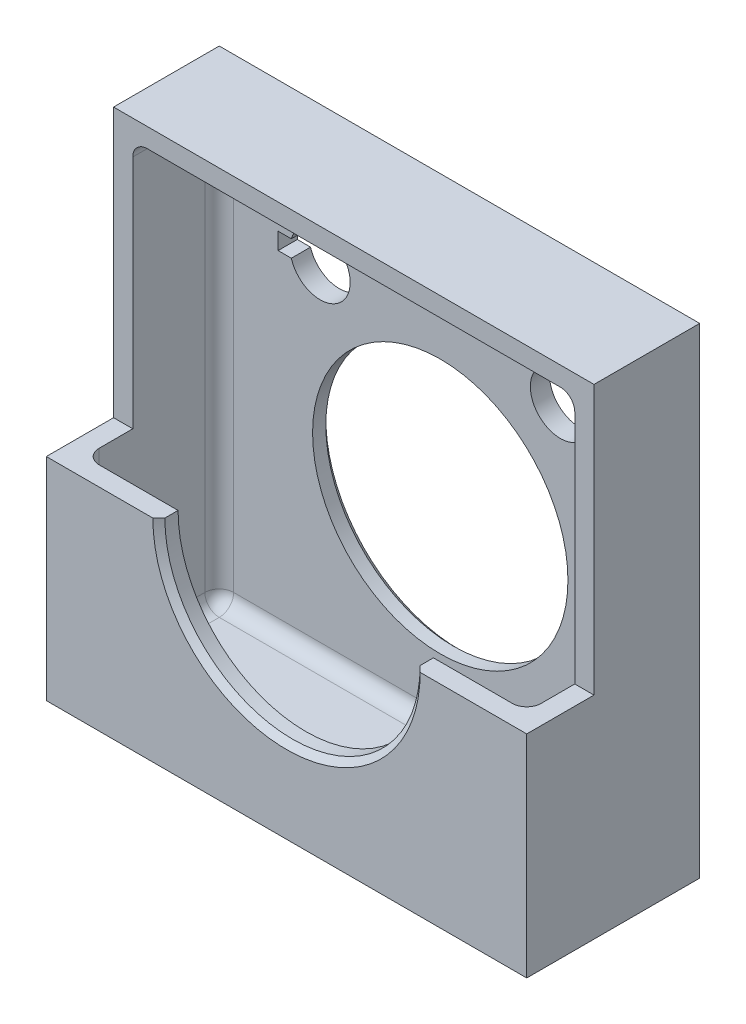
from build123d import *

# Parameters (mm, degrees)
SKETCH1_W          = 50.8
SKETCH1_H          = 50.8
MAIN_BODY_DEPTH    = 18.288
SKETCH2_W          = 7.112
SKETCH2_H          = 28.448
FRONT_CUT_DEPTH    = 75.133197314
SHELL1_T           = -2.032
SKETCH3_R          = 13.5001
CENTER_HOLE_DEPTH  = 75.133197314
FILL060_VERT_R     = 1.524
FILL060_TB_R       = 1.524
CHAM025_SIZE       = 0.635
KEYED_HOLE_1_DEPTH = 60.460200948


with BuildPart() as part:
    # Sketch1 → main body (new body)
    with BuildSketch(Plane.XY):
        with Locations((25.4, 25.4)):
            Rectangle(SKETCH1_W, SKETCH1_H)
    extrude(amount=MAIN_BODY_DEPTH)

    # Sketch2 → front cut (cut, through all)
    with BuildSketch(Plane(origin=(50.8, 0, 0), x_dir=(0, 0, -1), z_dir=(1, 0, 0))):
        with Locations((-14.732, 36.576)):
            Rectangle(SKETCH2_W, SKETCH2_H)
    extrude(amount=-FRONT_CUT_DEPTH, mode=Mode.SUBTRACT)

    # Shell1
    shell1_openings = [part.faces().sort_by_distance(p)[0] for p in [
        (25.4, 36.576, 11.176),
        (25.4, 22.352, 14.732),
    ]]
    offset(amount=SHELL1_T, openings=shell1_openings, kind=Kind.INTERSECTION)

    # Sketch3 → center hole (cut, through all)
    with BuildSketch(Plane.XY):
        with Locations((25.4, 22.352)):
            Circle(SKETCH3_R)
    extrude(amount=CENTER_HOLE_DEPTH, mode=Mode.SUBTRACT)

    # fill060.vert
    fill060_vert_edges = [part.edges().sort_by_distance(p)[0] for p in [
        (2.032, 12.192, 16.256),
        (48.768, 12.192, 16.256),
        (2.032, 25.4, 2.032),
        (48.768, 25.4, 2.032),
    ]]
    fillet(fill060_vert_edges, radius=FILL060_VERT_R)

    # fill060.tb
    fill060_tb_edges = [part.edges().sort_by_distance(p)[0] for p in [
        (2.032, 48.768, 7.366),
        (48.768, 48.768, 7.366),
        (25.4, 2.032, 16.256),
        (25.4, 2.032, 2.032),
        (2.032, 2.032, 9.144),
        (48.768, 2.032, 9.144),
        (2.478369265, 2.032, 15.809630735),
        (2.478369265, 2.032, 2.478369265),
        (48.321630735, 2.032, 2.478369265),
        (48.321630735, 2.032, 15.809630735),
        (25.4, 48.768, 2.032),
        (2.478369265, 48.768, 2.478369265),
        (48.321630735, 48.768, 2.478369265),
    ]]
    fillet(fill060_tb_edges, radius=FILL060_TB_R)

    # cham025
    cham025_edges = [part.edges().sort_by_distance(p)[0] for p in [
        (11.8999, 22.352, 0),
        (25.4, 8.8519, 18.288),
    ]]
    chamfer(cham025_edges, length=CHAM025_SIZE)

    # Sketch6 → Keyed Hole 1 (cut, through all)
    with BuildSketch(Plane(origin=(10.255789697, 39.461773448, 0), x_dir=(-1, 0, 0), z_dir=(0, 0, -1))):
        with BuildLine():
            Line((0.603789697, -0.472773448), (2.000789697, -0.472773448))
            Line((2.000789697, -0.472773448), (2.000789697, -2.250773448))
            Line((2.000789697, -2.250773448), (0.603789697, -2.250773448))
            ThreePointArc((0.603789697, -2.250773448), (-5.619210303, -1.361773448), (0.603789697, -0.472773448))
        make_face()
    keyed_hole_1 = extrude(amount=-KEYED_HOLE_1_DEPTH, mode=Mode.SUBTRACT)

    # Mirror1: Keyed Hole 1 across plane
    add(keyed_hole_1.mirror(Plane(origin=(25.4, 0, 0), x_dir=(0, 0, 1), z_dir=(1, 0, 0))), mode=Mode.SUBTRACT)


solid = part.part
